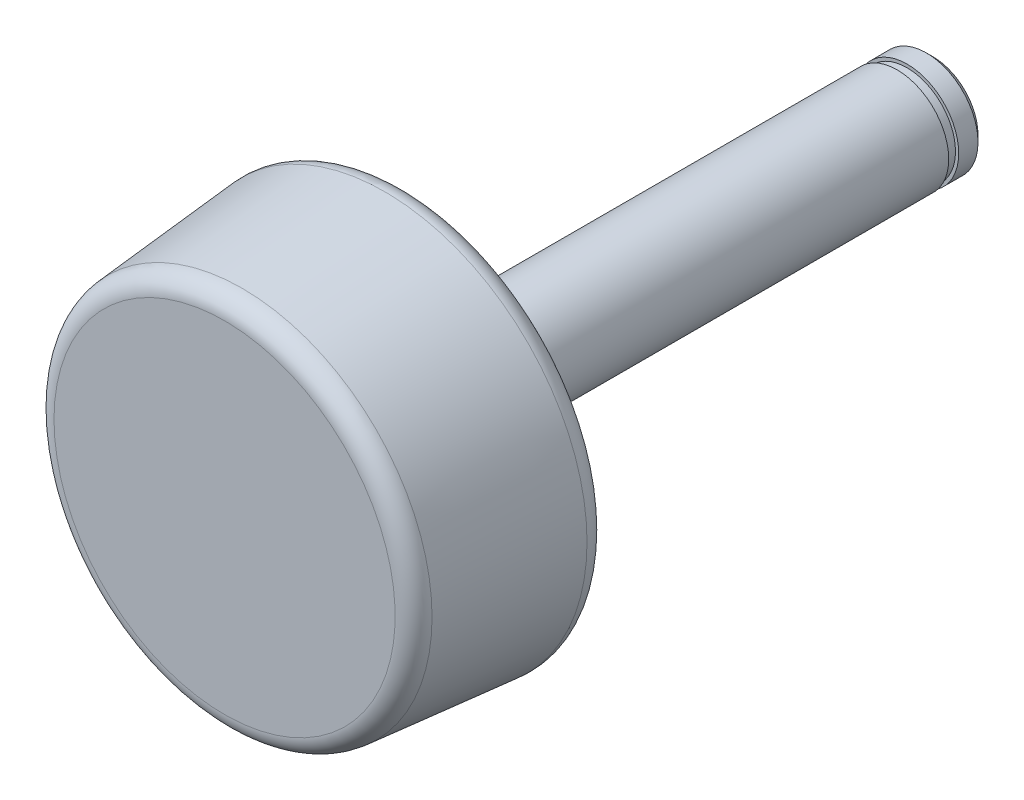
from build123d import *

# Parameters (mm, degrees)
CONG_1_R        = 3
ESQUISSE2_W     = 0.5
ESQUISSE2_H     = 1.55
CHANFREIN1_SIZE = 1


with BuildPart() as part:
    # Esquisse1 → R_volution1 (revolve)
    with BuildSketch(Plane(origin=(0, 0, 0), x_dir=(0, 0, -1), z_dir=(1, 0, 0)), mode=Mode.PRIVATE) as r_volution1_sk:
        Polygon((0, 0), (110, 0), (110, 8), (28.13, 8), (28.13, 31.7), (0, 29.24), align=None)
    revolve(r_volution1_sk.sketch.rotate(Axis((0, 0, 27.626070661), (0, 0, -1)), 90), axis=Axis((0, 0, 27.626070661), (0, 0, -1)))

    # Cong_1
    cong_1_edges = [part.edges().sort_by_distance(p)[0] for p in [
        (-29.24, 0, 0),
        (-31.7, 0, -28.13),
    ]]
    fillet(cong_1_edges, radius=CONG_1_R)

    # Esquisse2 → Enl_vement de mati_re-R_volution1 (revolve, cut)
    with BuildSketch(Plane(origin=(0, 0, 0), x_dir=(1, 0, 0), z_dir=(0, 1, 0)), mode=Mode.PRIVATE) as enl_vement_de_mati_re_r_volution1_sk:
        with Locations((-7.75, 105.225)):
            Rectangle(ESQUISSE2_W, ESQUISSE2_H)
    revolve(enl_vement_de_mati_re_r_volution1_sk.sketch.rotate(Axis((0, 0, -110), (0, 0, 1)), 180), axis=Axis((0, 0, -110), (0, 0, 1)), mode=Mode.SUBTRACT)

    # Chanfrein1
    chanfrein1_edges = [part.edges().sort_by_distance(p)[0] for p in [
        (-8, 0, -110),
    ]]
    chamfer(chanfrein1_edges, length=CHANFREIN1_SIZE)


solid = part.part
